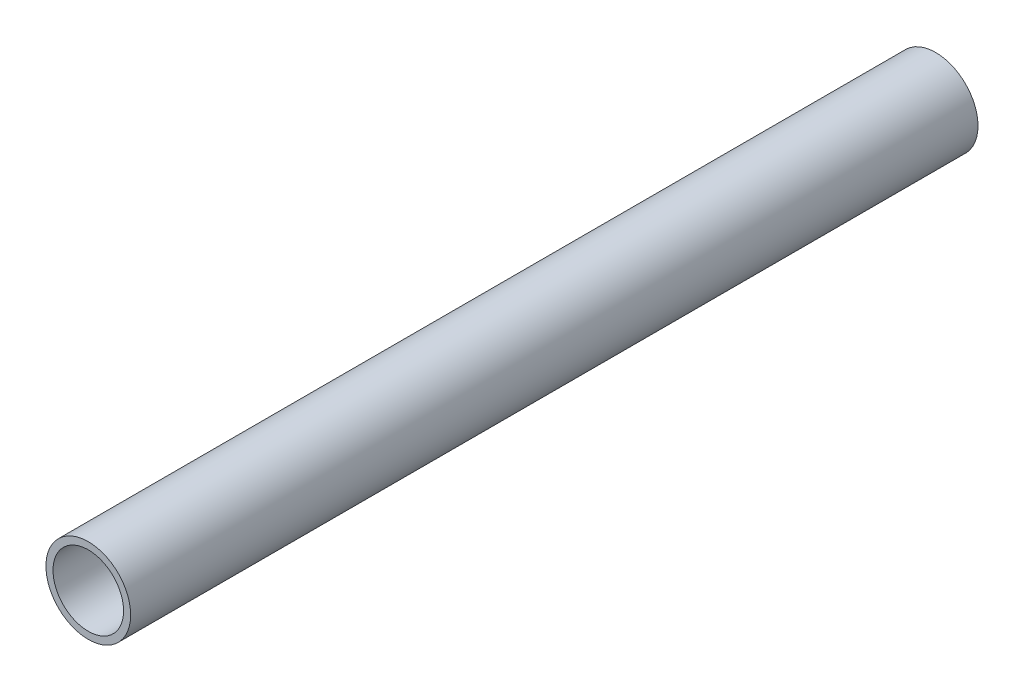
ISO-10303-21;
HEADER;
FILE_DESCRIPTION(('STEP AP214'),'2;1');
FILE_NAME('part.step','',(''),(''),'','','');
FILE_SCHEMA(('AUTOMOTIVE_DESIGN { 1 0 10303 214 1 1 1 1 }'));
ENDSEC;
DATA;
#1=APPLICATION_CONTEXT('core data for automotive mechanical design processes');
#2=APPLICATION_PROTOCOL_DEFINITION('international standard','automotive_design',2000,#1);
#3=PRODUCT_CONTEXT('',#1,'mechanical');
#4=PRODUCT('Part','Part','',(#3));
#5=PRODUCT_RELATED_PRODUCT_CATEGORY('part','',(#4));
#6=PRODUCT_DEFINITION_FORMATION('','',#4);
#7=PRODUCT_DEFINITION_CONTEXT('part definition',#1,'design');
#8=PRODUCT_DEFINITION('design','',#6,#7);
#9=PRODUCT_DEFINITION_SHAPE('','',#8);
#10=(LENGTH_UNIT() NAMED_UNIT(*) SI_UNIT(.MILLI.,.METRE.));
#11=(NAMED_UNIT(*) PLANE_ANGLE_UNIT() SI_UNIT($,.RADIAN.));
#12=(NAMED_UNIT(*) SI_UNIT($,.STERADIAN.) SOLID_ANGLE_UNIT());
#13=UNCERTAINTY_MEASURE_WITH_UNIT(LENGTH_MEASURE(1.E-05),#10,'distance_accuracy_value','');
#14=(GEOMETRIC_REPRESENTATION_CONTEXT(3) GLOBAL_UNCERTAINTY_ASSIGNED_CONTEXT((#13)) GLOBAL_UNIT_ASSIGNED_CONTEXT((#10,
#11,#12)) REPRESENTATION_CONTEXT('',''));
#15=CARTESIAN_POINT('',(0.,0.,0.));
#16=DIRECTION('',(0.,0.,1.));
#17=DIRECTION('',(1.,0.,0.));
#18=AXIS2_PLACEMENT_3D('',#15,#16,#17);
#19=CARTESIAN_POINT('',(0.,0.,600.));
#20=DIRECTION('',(0.,0.,1.));
#21=DIRECTION('',(1.,0.,0.));
#22=AXIS2_PLACEMENT_3D('',#19,#20,#21);
#23=PLANE('',#22);
#24=CARTESIAN_POINT('',(0.,0.,600.));
#25=DIRECTION('',(0.,0.,1.));
#26=DIRECTION('',(1.,0.,0.));
#27=AXIS2_PLACEMENT_3D('',#24,#25,#26);
#28=CIRCLE('',#27,30.);
#29=CARTESIAN_POINT('',(30.,0.,600.));
#30=VERTEX_POINT('',#29);
#31=EDGE_CURVE('E10',#30,#30,#28,.T.);
#32=ORIENTED_EDGE('',*,*,#31,.T.);
#33=EDGE_LOOP('',(#32));
#34=FACE_BOUND('',#33,.T.);
#35=CARTESIAN_POINT('',(0.,0.,600.));
#36=DIRECTION('',(0.,0.,1.));
#37=DIRECTION('',(1.,0.,0.));
#38=AXIS2_PLACEMENT_3D('',#35,#36,#37);
#39=CIRCLE('',#38,25.);
#40=CARTESIAN_POINT('',(25.,0.,600.));
#41=VERTEX_POINT('',#40);
#42=EDGE_CURVE('E40',#41,#41,#39,.T.);
#43=ORIENTED_EDGE('',*,*,#42,.F.);
#44=EDGE_LOOP('',(#43));
#45=FACE_BOUND('',#44,.T.);
#46=ADVANCED_FACE('F29',(#34,#45),#23,.T.);
#47=CARTESIAN_POINT('',(0.,0.,0.));
#48=DIRECTION('',(0.,0.,1.));
#49=DIRECTION('',(1.,0.,0.));
#50=AXIS2_PLACEMENT_3D('',#47,#48,#49);
#51=PLANE('',#50);
#52=CARTESIAN_POINT('',(0.,0.,0.));
#53=DIRECTION('',(0.,0.,1.));
#54=DIRECTION('',(1.,0.,0.));
#55=AXIS2_PLACEMENT_3D('',#52,#53,#54);
#56=CIRCLE('',#55,30.);
#57=CARTESIAN_POINT('',(30.,0.,0.));
#58=VERTEX_POINT('',#57);
#59=EDGE_CURVE('E36',#58,#58,#56,.T.);
#60=ORIENTED_EDGE('',*,*,#59,.F.);
#61=EDGE_LOOP('',(#60));
#62=FACE_BOUND('',#61,.T.);
#63=CARTESIAN_POINT('',(0.,0.,0.));
#64=DIRECTION('',(0.,0.,1.));
#65=DIRECTION('',(1.,0.,0.));
#66=AXIS2_PLACEMENT_3D('',#63,#64,#65);
#67=CIRCLE('',#66,25.);
#68=CARTESIAN_POINT('',(25.,0.,0.));
#69=VERTEX_POINT('',#68);
#70=EDGE_CURVE('E44',#69,#69,#67,.T.);
#71=ORIENTED_EDGE('',*,*,#70,.T.);
#72=EDGE_LOOP('',(#71));
#73=FACE_BOUND('',#72,.T.);
#74=ADVANCED_FACE('F50',(#62,#73),#51,.F.);
#75=CARTESIAN_POINT('',(0.,0.,600.));
#76=DIRECTION('',(0.,0.,-1.));
#77=DIRECTION('',(-1.,0.,0.));
#78=AXIS2_PLACEMENT_3D('',#75,#76,#77);
#79=CYLINDRICAL_SURFACE('',#78,30.);
#80=ORIENTED_EDGE('',*,*,#31,.F.);
#81=EDGE_LOOP('',(#80));
#82=FACE_BOUND('',#81,.T.);
#83=ORIENTED_EDGE('',*,*,#59,.T.);
#84=EDGE_LOOP('',(#83));
#85=FACE_BOUND('',#84,.T.);
#86=ADVANCED_FACE('F31',(#82,#85),#79,.T.);
#87=CARTESIAN_POINT('',(0.,0.,600.));
#88=DIRECTION('',(0.,0.,-1.));
#89=DIRECTION('',(-1.,0.,0.));
#90=AXIS2_PLACEMENT_3D('',#87,#88,#89);
#91=CYLINDRICAL_SURFACE('',#90,25.);
#92=ORIENTED_EDGE('',*,*,#42,.T.);
#93=EDGE_LOOP('',(#92));
#94=FACE_BOUND('',#93,.T.);
#95=ORIENTED_EDGE('',*,*,#70,.F.);
#96=EDGE_LOOP('',(#95));
#97=FACE_BOUND('',#96,.T.);
#98=ADVANCED_FACE('F52',(#94,#97),#91,.F.);
#99=CLOSED_SHELL('',(#46,#74,#86,#98));
#100=MANIFOLD_SOLID_BREP('B2',#99);
#101=ADVANCED_BREP_SHAPE_REPRESENTATION('',(#18,#100),#14);
#102=SHAPE_DEFINITION_REPRESENTATION(#9,#101);
ENDSEC;
END-ISO-10303-21;
